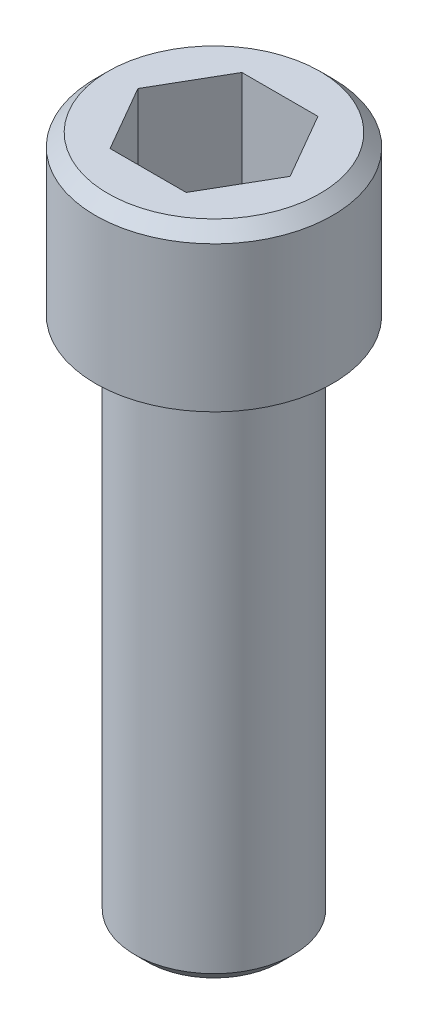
ISO-10303-21;
HEADER;
FILE_DESCRIPTION(('STEP AP214'),'2;1');
FILE_NAME('part.step','',(''),(''),'','','');
FILE_SCHEMA(('AUTOMOTIVE_DESIGN { 1 0 10303 214 1 1 1 1 }'));
ENDSEC;
DATA;
#1=APPLICATION_CONTEXT('core data for automotive mechanical design processes');
#2=APPLICATION_PROTOCOL_DEFINITION('international standard','automotive_design',2000,#1);
#3=PRODUCT_CONTEXT('',#1,'mechanical');
#4=PRODUCT('Part','Part','',(#3));
#5=PRODUCT_RELATED_PRODUCT_CATEGORY('part','',(#4));
#6=PRODUCT_DEFINITION_FORMATION('','',#4);
#7=PRODUCT_DEFINITION_CONTEXT('part definition',#1,'design');
#8=PRODUCT_DEFINITION('design','',#6,#7);
#9=PRODUCT_DEFINITION_SHAPE('','',#8);
#10=(LENGTH_UNIT() NAMED_UNIT(*) SI_UNIT(.MILLI.,.METRE.));
#11=(NAMED_UNIT(*) PLANE_ANGLE_UNIT() SI_UNIT($,.RADIAN.));
#12=(NAMED_UNIT(*) SI_UNIT($,.STERADIAN.) SOLID_ANGLE_UNIT());
#13=UNCERTAINTY_MEASURE_WITH_UNIT(LENGTH_MEASURE(1.E-05),#10,'distance_accuracy_value','');
#14=(GEOMETRIC_REPRESENTATION_CONTEXT(3) GLOBAL_UNCERTAINTY_ASSIGNED_CONTEXT((#13)) GLOBAL_UNIT_ASSIGNED_CONTEXT((#10,
#11,#12)) REPRESENTATION_CONTEXT('',''));
#15=CARTESIAN_POINT('',(0.,0.,0.));
#16=DIRECTION('',(0.,0.,1.));
#17=DIRECTION('',(1.,0.,0.));
#18=AXIS2_PLACEMENT_3D('',#15,#16,#17);
#19=CARTESIAN_POINT('',(0.,0.,0.));
#20=DIRECTION('',(0.,-1.,0.));
#21=DIRECTION('',(0.,0.,-1.));
#22=AXIS2_PLACEMENT_3D('',#19,#20,#21);
#23=CYLINDRICAL_SURFACE('',#22,7.14375);
#24=CARTESIAN_POINT('',(0.,8.76299999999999,0.));
#25=DIRECTION('',(0.,1.,0.));
#26=DIRECTION('',(0.,0.,1.));
#27=AXIS2_PLACEMENT_3D('',#24,#25,#26);
#28=CIRCLE('',#27,7.14375);
#29=CARTESIAN_POINT('',(0.,8.76299999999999,-7.14375));
#30=VERTEX_POINT('',#29);
#31=EDGE_CURVE('E142',#30,#30,#28,.F.);
#32=ORIENTED_EDGE('',*,*,#31,.T.);
#33=EDGE_LOOP('',(#32));
#34=FACE_BOUND('',#33,.T.);
#35=CARTESIAN_POINT('',(0.,0.,0.));
#36=DIRECTION('',(0.,-1.,0.));
#37=DIRECTION('',(0.,0.,-1.));
#38=AXIS2_PLACEMENT_3D('',#35,#36,#37);
#39=CIRCLE('',#38,7.14375);
#40=CARTESIAN_POINT('',(0.,0.,-7.14375));
#41=VERTEX_POINT('',#40);
#42=EDGE_CURVE('E130',#41,#41,#39,.T.);
#43=ORIENTED_EDGE('',*,*,#42,.F.);
#44=EDGE_LOOP('',(#43));
#45=FACE_BOUND('',#44,.T.);
#46=ADVANCED_FACE('F31',(#34,#45),#23,.T.);
#47=CARTESIAN_POINT('',(7.14375,9.525,0.));
#48=DIRECTION('',(0.,1.,0.));
#49=DIRECTION('',(0.,0.,1.));
#50=AXIS2_PLACEMENT_3D('',#47,#48,#49);
#51=PLANE('',#50);
#52=CARTESIAN_POINT('',(0.,9.525,0.));
#53=DIRECTION('',(0.,1.,0.));
#54=DIRECTION('',(0.,0.,1.));
#55=AXIS2_PLACEMENT_3D('',#52,#53,#54);
#56=CIRCLE('',#55,6.38174999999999);
#57=CARTESIAN_POINT('',(0.,9.525,-6.38174999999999));
#58=VERTEX_POINT('',#57);
#59=EDGE_CURVE('E145',#58,#58,#56,.T.);
#60=ORIENTED_EDGE('',*,*,#59,.T.);
#61=EDGE_LOOP('',(#60));
#62=FACE_BOUND('',#61,.T.);
#63=DIRECTION('',(1.,0.,0.));
#64=VECTOR('',#63,1.);
#65=CARTESIAN_POINT('',(-2.29135888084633,9.525,3.96875));
#66=LINE('',#65,#64);
#67=CARTESIAN_POINT('',(-2.29135888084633,9.525,3.96875));
#68=VERTEX_POINT('',#67);
#69=CARTESIAN_POINT('',(2.29135888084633,9.525,3.96875));
#70=VERTEX_POINT('',#69);
#71=EDGE_CURVE('E45',#68,#70,#66,.T.);
#72=ORIENTED_EDGE('',*,*,#71,.F.);
#73=DIRECTION('',(0.5,0.,0.866025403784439));
#74=VECTOR('',#73,1.);
#75=CARTESIAN_POINT('',(-4.58271776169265,9.525,0.));
#76=LINE('',#75,#74);
#77=CARTESIAN_POINT('',(-4.58271776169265,9.525,0.));
#78=VERTEX_POINT('',#77);
#79=EDGE_CURVE('E114',#78,#68,#76,.T.);
#80=ORIENTED_EDGE('',*,*,#79,.F.);
#81=DIRECTION('',(0.5,0.,-0.866025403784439));
#82=VECTOR('',#81,1.);
#83=CARTESIAN_POINT('',(-4.58271776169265,9.525,0.));
#84=LINE('',#83,#82);
#85=CARTESIAN_POINT('',(-2.29135888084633,9.525,-3.96875));
#86=VERTEX_POINT('',#85);
#87=EDGE_CURVE('E109',#78,#86,#84,.T.);
#88=ORIENTED_EDGE('',*,*,#87,.T.);
#89=DIRECTION('',(1.,0.,0.));
#90=VECTOR('',#89,1.);
#91=CARTESIAN_POINT('',(-2.29135888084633,9.525,-3.96875));
#92=LINE('',#91,#90);
#93=CARTESIAN_POINT('',(2.29135888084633,9.525,-3.96875));
#94=VERTEX_POINT('',#93);
#95=EDGE_CURVE('E107',#86,#94,#92,.T.);
#96=ORIENTED_EDGE('',*,*,#95,.T.);
#97=DIRECTION('',(-0.5,0.,-0.866025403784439));
#98=VECTOR('',#97,1.);
#99=CARTESIAN_POINT('',(4.58271776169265,9.525,0.));
#100=LINE('',#99,#98);
#101=CARTESIAN_POINT('',(4.58271776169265,9.525,0.));
#102=VERTEX_POINT('',#101);
#103=EDGE_CURVE('E90',#102,#94,#100,.T.);
#104=ORIENTED_EDGE('',*,*,#103,.F.);
#105=DIRECTION('',(-0.5,0.,0.866025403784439));
#106=VECTOR('',#105,1.);
#107=CARTESIAN_POINT('',(4.58271776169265,9.525,0.));
#108=LINE('',#107,#106);
#109=EDGE_CURVE('E100',#102,#70,#108,.T.);
#110=ORIENTED_EDGE('',*,*,#109,.T.);
#111=EDGE_LOOP('',(#72,#80,#88,#96,#104,#110));
#112=FACE_BOUND('',#111,.T.);
#113=ADVANCED_FACE('F104',(#62,#112),#51,.T.);
#114=CARTESIAN_POINT('',(0.,-31.75,0.));
#115=DIRECTION('',(0.,-1.,0.));
#116=DIRECTION('',(0.,0.,-1.));
#117=AXIS2_PLACEMENT_3D('',#114,#115,#116);
#118=PLANE('',#117);
#119=CARTESIAN_POINT('',(0.,-31.75,0.));
#120=DIRECTION('',(0.,-1.,0.));
#121=DIRECTION('',(0.,0.,-1.));
#122=AXIS2_PLACEMENT_3D('',#119,#120,#121);
#123=CIRCLE('',#122,4.00049999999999);
#124=CARTESIAN_POINT('',(0.,-31.75,-4.00049999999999));
#125=VERTEX_POINT('',#124);
#126=EDGE_CURVE('E38',#125,#125,#123,.T.);
#127=ORIENTED_EDGE('',*,*,#126,.T.);
#128=EDGE_LOOP('',(#127));
#129=FACE_BOUND('',#128,.T.);
#130=ADVANCED_FACE('F150',(#129),#118,.T.);
#131=CARTESIAN_POINT('',(0.,0.,0.));
#132=DIRECTION('',(0.,-1.,0.));
#133=DIRECTION('',(0.,0.,-1.));
#134=AXIS2_PLACEMENT_3D('',#131,#132,#133);
#135=CYLINDRICAL_SURFACE('',#134,4.7625);
#136=CARTESIAN_POINT('',(0.,-30.988,0.));
#137=DIRECTION('',(0.,-1.,0.));
#138=DIRECTION('',(0.,0.,-1.));
#139=AXIS2_PLACEMENT_3D('',#136,#137,#138);
#140=CIRCLE('',#139,4.7625);
#141=CARTESIAN_POINT('',(0.,-30.988,-4.7625));
#142=VERTEX_POINT('',#141);
#143=EDGE_CURVE('E11',#142,#142,#140,.F.);
#144=ORIENTED_EDGE('',*,*,#143,.T.);
#145=EDGE_LOOP('',(#144));
#146=FACE_BOUND('',#145,.T.);
#147=CARTESIAN_POINT('',(0.,0.,0.));
#148=DIRECTION('',(0.,-1.,0.));
#149=DIRECTION('',(0.,0.,-1.));
#150=AXIS2_PLACEMENT_3D('',#147,#148,#149);
#151=CIRCLE('',#150,4.7625);
#152=CARTESIAN_POINT('',(0.,0.,-4.7625));
#153=VERTEX_POINT('',#152);
#154=EDGE_CURVE('E139',#153,#153,#151,.T.);
#155=ORIENTED_EDGE('',*,*,#154,.T.);
#156=EDGE_LOOP('',(#155));
#157=FACE_BOUND('',#156,.T.);
#158=ADVANCED_FACE('F178',(#146,#157),#135,.T.);
#159=CARTESIAN_POINT('',(4.7625,0.,0.));
#160=DIRECTION('',(0.,-1.,0.));
#161=DIRECTION('',(0.,0.,-1.));
#162=AXIS2_PLACEMENT_3D('',#159,#160,#161);
#163=PLANE('',#162);
#164=ORIENTED_EDGE('',*,*,#42,.T.);
#165=EDGE_LOOP('',(#164));
#166=FACE_BOUND('',#165,.T.);
#167=ORIENTED_EDGE('',*,*,#154,.F.);
#168=EDGE_LOOP('',(#167));
#169=FACE_BOUND('',#168,.T.);
#170=ADVANCED_FACE('F174',(#166,#169),#163,.T.);
#171=CARTESIAN_POINT('',(-2.29135888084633,3.175,3.96875));
#172=DIRECTION('',(0.,0.,1.));
#173=DIRECTION('',(1.,0.,0.));
#174=AXIS2_PLACEMENT_3D('',#171,#172,#173);
#175=PLANE('',#174);
#176=ORIENTED_EDGE('',*,*,#71,.T.);
#177=DIRECTION('',(0.,1.,0.));
#178=VECTOR('',#177,1.);
#179=CARTESIAN_POINT('',(2.29135888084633,3.175,3.96875));
#180=LINE('',#179,#178);
#181=CARTESIAN_POINT('',(2.29135888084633,3.175,3.96875));
#182=VERTEX_POINT('',#181);
#183=EDGE_CURVE('E97',#182,#70,#180,.T.);
#184=ORIENTED_EDGE('',*,*,#183,.F.);
#185=DIRECTION('',(1.,0.,0.));
#186=VECTOR('',#185,1.);
#187=CARTESIAN_POINT('',(-2.29135888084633,3.175,3.96875));
#188=LINE('',#187,#186);
#189=CARTESIAN_POINT('',(-2.29135888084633,3.175,3.96875));
#190=VERTEX_POINT('',#189);
#191=EDGE_CURVE('E116',#190,#182,#188,.T.);
#192=ORIENTED_EDGE('',*,*,#191,.F.);
#193=DIRECTION('',(0.,1.,0.));
#194=VECTOR('',#193,1.);
#195=CARTESIAN_POINT('',(-2.29135888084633,3.175,3.96875));
#196=LINE('',#195,#194);
#197=EDGE_CURVE('E52',#190,#68,#196,.T.);
#198=ORIENTED_EDGE('',*,*,#197,.T.);
#199=EDGE_LOOP('',(#176,#184,#192,#198));
#200=FACE_BOUND('',#199,.T.);
#201=ADVANCED_FACE('F177',(#200),#175,.F.);
#202=CARTESIAN_POINT('',(-4.58271776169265,3.175,0.));
#203=DIRECTION('',(-0.866025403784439,0.,0.5));
#204=DIRECTION('',(0.5,0.,0.866025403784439));
#205=AXIS2_PLACEMENT_3D('',#202,#203,#204);
#206=PLANE('',#205);
#207=ORIENTED_EDGE('',*,*,#79,.T.);
#208=ORIENTED_EDGE('',*,*,#197,.F.);
#209=DIRECTION('',(0.5,0.,0.866025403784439));
#210=VECTOR('',#209,1.);
#211=CARTESIAN_POINT('',(-4.58271776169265,3.175,0.));
#212=LINE('',#211,#210);
#213=CARTESIAN_POINT('',(-4.58271776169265,3.175,0.));
#214=VERTEX_POINT('',#213);
#215=EDGE_CURVE('E126',#214,#190,#212,.T.);
#216=ORIENTED_EDGE('',*,*,#215,.F.);
#217=DIRECTION('',(0.,1.,0.));
#218=VECTOR('',#217,1.);
#219=CARTESIAN_POINT('',(-4.58271776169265,3.175,0.));
#220=LINE('',#219,#218);
#221=EDGE_CURVE('E131',#214,#78,#220,.T.);
#222=ORIENTED_EDGE('',*,*,#221,.T.);
#223=EDGE_LOOP('',(#207,#208,#216,#222));
#224=FACE_BOUND('',#223,.T.);
#225=ADVANCED_FACE('F192',(#224),#206,.F.);
#226=CARTESIAN_POINT('',(-4.58271776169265,3.175,0.));
#227=DIRECTION('',(0.866025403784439,0.,0.5));
#228=DIRECTION('',(0.5,0.,-0.866025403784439));
#229=AXIS2_PLACEMENT_3D('',#226,#227,#228);
#230=PLANE('',#229);
#231=ORIENTED_EDGE('',*,*,#87,.F.);
#232=ORIENTED_EDGE('',*,*,#221,.F.);
#233=DIRECTION('',(0.5,0.,-0.866025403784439));
#234=VECTOR('',#233,1.);
#235=CARTESIAN_POINT('',(-4.58271776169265,3.175,0.));
#236=LINE('',#235,#234);
#237=CARTESIAN_POINT('',(-2.29135888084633,3.175,-3.96875));
#238=VERTEX_POINT('',#237);
#239=EDGE_CURVE('E124',#214,#238,#236,.T.);
#240=ORIENTED_EDGE('',*,*,#239,.T.);
#241=DIRECTION('',(0.,1.,0.));
#242=VECTOR('',#241,1.);
#243=CARTESIAN_POINT('',(-2.29135888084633,3.175,-3.96875));
#244=LINE('',#243,#242);
#245=EDGE_CURVE('E133',#238,#86,#244,.T.);
#246=ORIENTED_EDGE('',*,*,#245,.T.);
#247=EDGE_LOOP('',(#231,#232,#240,#246));
#248=FACE_BOUND('',#247,.T.);
#249=ADVANCED_FACE('F200',(#248),#230,.T.);
#250=CARTESIAN_POINT('',(-2.29135888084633,3.175,-3.96875));
#251=DIRECTION('',(0.,0.,1.));
#252=DIRECTION('',(1.,0.,0.));
#253=AXIS2_PLACEMENT_3D('',#250,#251,#252);
#254=PLANE('',#253);
#255=ORIENTED_EDGE('',*,*,#95,.F.);
#256=ORIENTED_EDGE('',*,*,#245,.F.);
#257=DIRECTION('',(1.,0.,0.));
#258=VECTOR('',#257,1.);
#259=CARTESIAN_POINT('',(-2.29135888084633,3.175,-3.96875));
#260=LINE('',#259,#258);
#261=CARTESIAN_POINT('',(2.29135888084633,3.175,-3.96875));
#262=VERTEX_POINT('',#261);
#263=EDGE_CURVE('E122',#238,#262,#260,.T.);
#264=ORIENTED_EDGE('',*,*,#263,.T.);
#265=DIRECTION('',(0.,1.,0.));
#266=VECTOR('',#265,1.);
#267=CARTESIAN_POINT('',(2.29135888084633,3.175,-3.96875));
#268=LINE('',#267,#266);
#269=EDGE_CURVE('E96',#262,#94,#268,.T.);
#270=ORIENTED_EDGE('',*,*,#269,.T.);
#271=EDGE_LOOP('',(#255,#256,#264,#270));
#272=FACE_BOUND('',#271,.T.);
#273=ADVANCED_FACE('F197',(#272),#254,.T.);
#274=CARTESIAN_POINT('',(4.58271776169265,3.175,0.));
#275=DIRECTION('',(0.866025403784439,0.,-0.5));
#276=DIRECTION('',(-0.5,0.,-0.866025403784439));
#277=AXIS2_PLACEMENT_3D('',#274,#275,#276);
#278=PLANE('',#277);
#279=ORIENTED_EDGE('',*,*,#103,.T.);
#280=ORIENTED_EDGE('',*,*,#269,.F.);
#281=DIRECTION('',(-0.5,0.,-0.866025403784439));
#282=VECTOR('',#281,1.);
#283=CARTESIAN_POINT('',(4.58271776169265,3.175,0.));
#284=LINE('',#283,#282);
#285=CARTESIAN_POINT('',(4.58271776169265,3.175,0.));
#286=VERTEX_POINT('',#285);
#287=EDGE_CURVE('E93',#286,#262,#284,.T.);
#288=ORIENTED_EDGE('',*,*,#287,.F.);
#289=DIRECTION('',(0.,1.,0.));
#290=VECTOR('',#289,1.);
#291=CARTESIAN_POINT('',(4.58271776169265,3.175,0.));
#292=LINE('',#291,#290);
#293=EDGE_CURVE('E85',#286,#102,#292,.T.);
#294=ORIENTED_EDGE('',*,*,#293,.T.);
#295=EDGE_LOOP('',(#279,#280,#288,#294));
#296=FACE_BOUND('',#295,.T.);
#297=ADVANCED_FACE('F87',(#296),#278,.F.);
#298=CARTESIAN_POINT('',(4.58271776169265,3.175,0.));
#299=DIRECTION('',(-0.866025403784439,0.,-0.5));
#300=DIRECTION('',(-0.5,0.,0.866025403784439));
#301=AXIS2_PLACEMENT_3D('',#298,#299,#300);
#302=PLANE('',#301);
#303=ORIENTED_EDGE('',*,*,#109,.F.);
#304=ORIENTED_EDGE('',*,*,#293,.F.);
#305=DIRECTION('',(-0.5,0.,0.866025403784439));
#306=VECTOR('',#305,1.);
#307=CARTESIAN_POINT('',(4.58271776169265,3.175,0.));
#308=LINE('',#307,#306);
#309=EDGE_CURVE('E119',#286,#182,#308,.T.);
#310=ORIENTED_EDGE('',*,*,#309,.T.);
#311=ORIENTED_EDGE('',*,*,#183,.T.);
#312=EDGE_LOOP('',(#303,#304,#310,#311));
#313=FACE_BOUND('',#312,.T.);
#314=ADVANCED_FACE('F101',(#313),#302,.T.);
#315=CARTESIAN_POINT('',(2.29135888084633,3.175,3.96875));
#316=DIRECTION('',(0.,-1.,0.));
#317=DIRECTION('',(0.,0.,-1.));
#318=AXIS2_PLACEMENT_3D('',#315,#316,#317);
#319=PLANE('',#318);
#320=ORIENTED_EDGE('',*,*,#191,.T.);
#321=ORIENTED_EDGE('',*,*,#309,.F.);
#322=ORIENTED_EDGE('',*,*,#287,.T.);
#323=ORIENTED_EDGE('',*,*,#263,.F.);
#324=ORIENTED_EDGE('',*,*,#239,.F.);
#325=ORIENTED_EDGE('',*,*,#215,.T.);
#326=EDGE_LOOP('',(#320,#321,#322,#323,#324,#325));
#327=FACE_BOUND('',#326,.T.);
#328=ADVANCED_FACE('F160',(#327),#319,.F.);
#329=CARTESIAN_POINT('',(0.,8.76299999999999,0.));
#330=DIRECTION('',(0.,-1.,0.));
#331=DIRECTION('',(0.,0.,-1.));
#332=AXIS2_PLACEMENT_3D('',#329,#330,#331);
#333=CONICAL_SURFACE('',#332,7.14375,0.785398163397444);
#334=CARTESIAN_POINT('',(0.,9.525,-6.38174999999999));
#335=CARTESIAN_POINT('',(0.,9.5170625,-6.3896875));
#336=CARTESIAN_POINT('',(0.,9.509125,-6.397625));
#337=CARTESIAN_POINT('',(0.,9.49325,-6.41349999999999));
#338=CARTESIAN_POINT('',(0.,9.4853125,-6.42143749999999));
#339=CARTESIAN_POINT('',(0.,9.4694375,-6.43731249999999));
#340=CARTESIAN_POINT('',(0.,9.4615,-6.44524999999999));
#341=CARTESIAN_POINT('',(0.,9.445625,-6.46112499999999));
#342=CARTESIAN_POINT('',(0.,9.4376875,-6.46906249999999));
#343=CARTESIAN_POINT('',(0.,9.4218125,-6.48493749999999));
#344=CARTESIAN_POINT('',(0.,9.413875,-6.492875));
#345=CARTESIAN_POINT('',(0.,9.398,-6.50875));
#346=CARTESIAN_POINT('',(0.,9.3900625,-6.5166875));
#347=CARTESIAN_POINT('',(0.,9.3741875,-6.5325625));
#348=CARTESIAN_POINT('',(0.,9.36625,-6.5405));
#349=CARTESIAN_POINT('',(0.,9.350375,-6.556375));
#350=CARTESIAN_POINT('',(0.,9.3424375,-6.5643125));
#351=CARTESIAN_POINT('',(0.,9.3265625,-6.5801875));
#352=CARTESIAN_POINT('',(0.,9.318625,-6.588125));
#353=CARTESIAN_POINT('',(0.,9.30275,-6.604));
#354=CARTESIAN_POINT('',(0.,9.2948125,-6.6119375));
#355=CARTESIAN_POINT('',(0.,9.2789375,-6.6278125));
#356=CARTESIAN_POINT('',(0.,9.271,-6.63575));
#357=CARTESIAN_POINT('',(0.,9.255125,-6.651625));
#358=CARTESIAN_POINT('',(0.,9.2471875,-6.6595625));
#359=CARTESIAN_POINT('',(0.,9.2313125,-6.6754375));
#360=CARTESIAN_POINT('',(0.,9.223375,-6.683375));
#361=CARTESIAN_POINT('',(0.,9.2075,-6.69925));
#362=CARTESIAN_POINT('',(0.,9.1995625,-6.7071875));
#363=CARTESIAN_POINT('',(0.,9.1836875,-6.7230625));
#364=CARTESIAN_POINT('',(0.,9.17575,-6.731));
#365=CARTESIAN_POINT('',(0.,9.15987499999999,-6.746875));
#366=CARTESIAN_POINT('',(0.,9.1519375,-6.7548125));
#367=CARTESIAN_POINT('',(0.,9.13606249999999,-6.7706875));
#368=CARTESIAN_POINT('',(0.,9.12812499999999,-6.778625));
#369=CARTESIAN_POINT('',(0.,9.11224999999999,-6.7945));
#370=CARTESIAN_POINT('',(0.,9.10431249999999,-6.8024375));
#371=CARTESIAN_POINT('',(0.,9.08843749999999,-6.8183125));
#372=CARTESIAN_POINT('',(0.,9.08049999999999,-6.82625));
#373=CARTESIAN_POINT('',(0.,9.06462499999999,-6.842125));
#374=CARTESIAN_POINT('',(0.,9.05668749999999,-6.8500625));
#375=CARTESIAN_POINT('',(0.,9.04081249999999,-6.8659375));
#376=CARTESIAN_POINT('',(0.,9.03287499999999,-6.873875));
#377=CARTESIAN_POINT('',(0.,9.01699999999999,-6.88975));
#378=CARTESIAN_POINT('',(0.,9.00906249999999,-6.8976875));
#379=CARTESIAN_POINT('',(0.,8.99318749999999,-6.9135625));
#380=CARTESIAN_POINT('',(0.,8.98524999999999,-6.9215));
#381=CARTESIAN_POINT('',(0.,8.96937499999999,-6.937375));
#382=CARTESIAN_POINT('',(0.,8.96143749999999,-6.9453125));
#383=CARTESIAN_POINT('',(0.,8.94556249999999,-6.9611875));
#384=CARTESIAN_POINT('',(0.,8.93762499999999,-6.969125));
#385=CARTESIAN_POINT('',(0.,8.92174999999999,-6.985));
#386=CARTESIAN_POINT('',(0.,8.91381249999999,-6.9929375));
#387=CARTESIAN_POINT('',(0.,8.89793749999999,-7.0088125));
#388=CARTESIAN_POINT('',(0.,8.88999999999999,-7.01675));
#389=CARTESIAN_POINT('',(0.,8.87412499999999,-7.032625));
#390=CARTESIAN_POINT('',(0.,8.86618749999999,-7.0405625));
#391=CARTESIAN_POINT('',(0.,8.85031249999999,-7.0564375));
#392=CARTESIAN_POINT('',(0.,8.84237499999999,-7.064375));
#393=CARTESIAN_POINT('',(0.,8.82649999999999,-7.08025));
#394=CARTESIAN_POINT('',(0.,8.81856249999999,-7.0881875));
#395=CARTESIAN_POINT('',(0.,8.80268749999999,-7.1040625));
#396=CARTESIAN_POINT('',(0.,8.79474999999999,-7.112));
#397=CARTESIAN_POINT('',(0.,8.77887499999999,-7.127875));
#398=CARTESIAN_POINT('',(0.,8.77093749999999,-7.1358125));
#399=CARTESIAN_POINT('',(0.,8.76299999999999,-7.14375));
#400=B_SPLINE_CURVE_WITH_KNOTS('',3,(#334,#335,#336,#337,#338,#339,#340,#341,#342,#343,#344,
#345,#346,#347,#348,#349,#350,#351,#352,#353,#354,#355,#356,#357,#358,#359,#360,#361,#362,#363,
#364,#365,#366,#367,#368,#369,#370,#371,#372,#373,#374,#375,#376,#377,#378,#379,#380,#381,#382,
#383,#384,#385,#386,#387,#388,#389,#390,#391,#392,#393,#394,#395,#396,#397,#398,#399),
.UNSPECIFIED.,.F.,.F.,(4,2,2,2,2,2,2,2,2,2,2,2,2,2,2,2,2,2,2,2,2,2,2,2,2,2,2,2,2,2,2,2,4),(0.,
0.0336759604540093,0.0673519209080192,0.101027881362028,0.134703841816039,0.168379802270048,
0.202055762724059,0.235731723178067,0.269407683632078,0.303083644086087,0.336759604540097,
0.370435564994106,0.404111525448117,0.437787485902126,0.471463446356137,0.505139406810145,
0.538815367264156,0.572491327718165,0.606167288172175,0.639843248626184,0.673519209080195,
0.707195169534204,0.740871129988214,0.774547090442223,0.808223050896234,0.841899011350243,
0.875574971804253,0.909250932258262,0.942926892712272,0.976602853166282,1.01027881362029,
1.0439547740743,1.07763073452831),.UNSPECIFIED.);
#401=EDGE_CURVE('BSEAM154',#58,#30,#400,.T.);
#402=ORIENTED_EDGE('',*,*,#59,.F.);
#403=ORIENTED_EDGE('',*,*,#31,.F.);
#404=ORIENTED_EDGE('',*,*,#401,.T.);
#405=ORIENTED_EDGE('',*,*,#401,.F.);
#406=EDGE_LOOP('',(#402,#404,#403,#405));
#407=FACE_BOUND('',#406,.T.);
#408=ADVANCED_FACE('F154',(#407),#333,.T.);
#409=CARTESIAN_POINT('',(0.,-31.75,0.));
#410=DIRECTION('',(0.,1.,0.));
#411=DIRECTION('',(0.,0.,1.));
#412=AXIS2_PLACEMENT_3D('',#409,#410,#411);
#413=CONICAL_SURFACE('',#412,4.00049999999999,0.785398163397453);
#414=ORIENTED_EDGE('',*,*,#143,.F.);
#415=EDGE_LOOP('',(#414));
#416=FACE_BOUND('',#415,.T.);
#417=ORIENTED_EDGE('',*,*,#126,.F.);
#418=EDGE_LOOP('',(#417));
#419=FACE_BOUND('',#418,.T.);
#420=ADVANCED_FACE('F152',(#416,#419),#413,.T.);
#421=CLOSED_SHELL('',(#46,#113,#130,#158,#170,#201,#225,#249,#273,#297,#314,#328,#408,#420));
#422=MANIFOLD_SOLID_BREP('B2',#421);
#423=ADVANCED_BREP_SHAPE_REPRESENTATION('',(#18,#422),#14);
#424=SHAPE_DEFINITION_REPRESENTATION(#9,#423);
ENDSEC;
END-ISO-10303-21;
